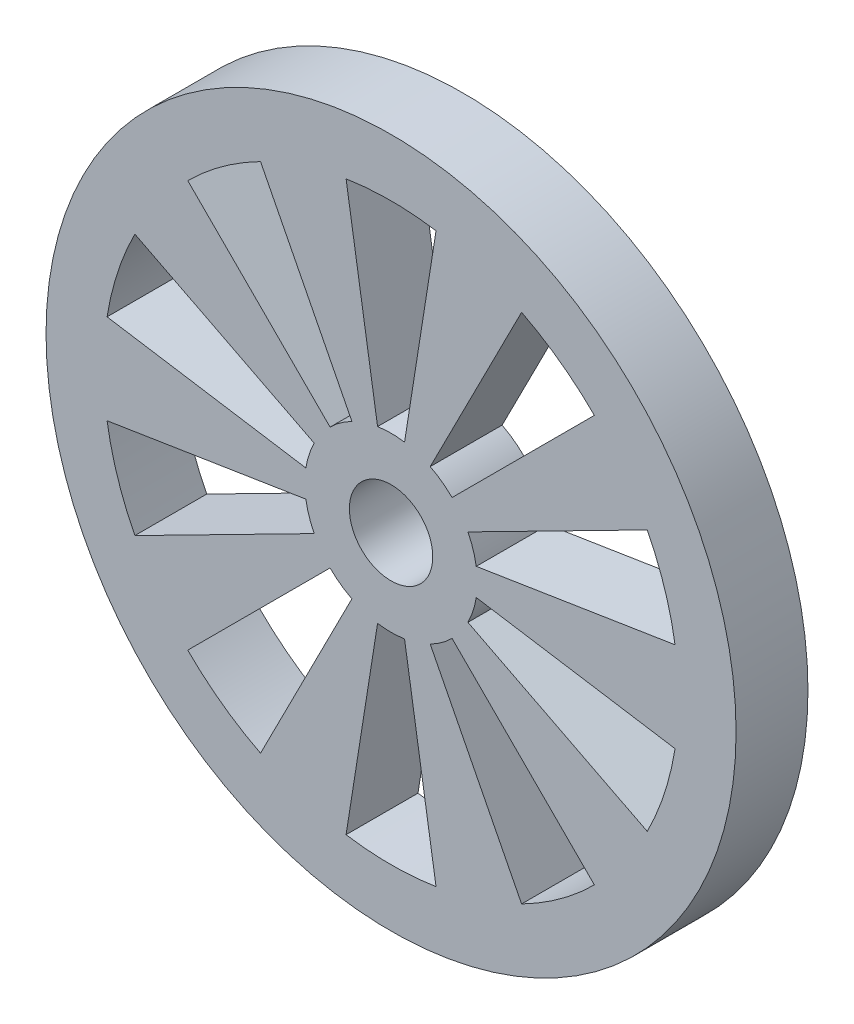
from build123d import *

# Parameters (mm, degrees)
CROQUIS1_R              = 12
CROQUIS1_R_2            = 1.45
SALIENTE_EXTRUIR1_DEPTH = 1.25
CORTAR_EXTRUIR1_DEPTH   = 18.153716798
MATRIZC1_COUNT          = 10


with BuildPart() as part:
    # Croquis1 → Saliente-Extruir1 (new, symmetric)
    with BuildSketch(Plane.XY):
        Circle(CROQUIS1_R)
        Circle(CROQUIS1_R_2, mode=Mode.SUBTRACT)
    extrude(amount=SALIENTE_EXTRUIR1_DEPTH, both=True)

    # Croquis2 → Cortar-Extruir1 (cut, symmetric)
    with BuildSketch(Plane.XY.offset(1.25)):
        with BuildLine():
            Line((-0.469303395, -2.963065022), (-1.56434465, -9.876883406))
            ThreePointArc((-1.56434465, -9.876883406), (0, -10), (1.56434465, -9.876883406))
            Line((1.56434465, -9.876883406), (0.469303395, -2.963065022))
            ThreePointArc((0.469303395, -2.963065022), (0, -3), (-0.469303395, -2.963065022))
        make_face()
    cortar_extruir1 = extrude(amount=CORTAR_EXTRUIR1_DEPTH, both=True, mode=Mode.SUBTRACT)

    # MatrizC1: Cortar-Extruir1 ×10 about axis
    matrizc1_axis = Axis((0, 0, 0), (0, 0, 1))
    for i in range(1, MATRIZC1_COUNT):
        add(cortar_extruir1.rotate(matrizc1_axis, i * 360 / MATRIZC1_COUNT), mode=Mode.SUBTRACT)


solid = part.part
